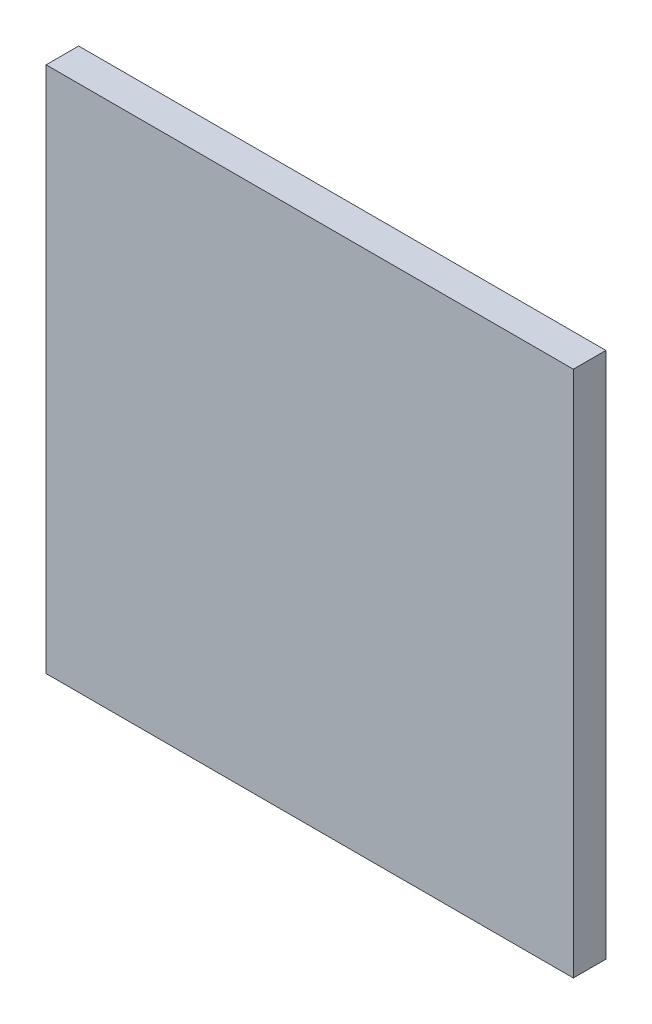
ISO-10303-21;
HEADER;
FILE_DESCRIPTION(('STEP AP214'),'2;1');
FILE_NAME('part.step','',(''),(''),'','','');
FILE_SCHEMA(('AUTOMOTIVE_DESIGN { 1 0 10303 214 1 1 1 1 }'));
ENDSEC;
DATA;
#1=APPLICATION_CONTEXT('core data for automotive mechanical design processes');
#2=APPLICATION_PROTOCOL_DEFINITION('international standard','automotive_design',2000,#1);
#3=PRODUCT_CONTEXT('',#1,'mechanical');
#4=PRODUCT('Part','Part','',(#3));
#5=PRODUCT_RELATED_PRODUCT_CATEGORY('part','',(#4));
#6=PRODUCT_DEFINITION_FORMATION('','',#4);
#7=PRODUCT_DEFINITION_CONTEXT('part definition',#1,'design');
#8=PRODUCT_DEFINITION('design','',#6,#7);
#9=PRODUCT_DEFINITION_SHAPE('','',#8);
#10=(LENGTH_UNIT() NAMED_UNIT(*) SI_UNIT(.MILLI.,.METRE.));
#11=(NAMED_UNIT(*) PLANE_ANGLE_UNIT() SI_UNIT($,.RADIAN.));
#12=(NAMED_UNIT(*) SI_UNIT($,.STERADIAN.) SOLID_ANGLE_UNIT());
#13=UNCERTAINTY_MEASURE_WITH_UNIT(LENGTH_MEASURE(1.E-05),#10,'distance_accuracy_value','');
#14=(GEOMETRIC_REPRESENTATION_CONTEXT(3) GLOBAL_UNCERTAINTY_ASSIGNED_CONTEXT((#13)) GLOBAL_UNIT_ASSIGNED_CONTEXT((#10,
#11,#12)) REPRESENTATION_CONTEXT('',''));
#15=CARTESIAN_POINT('',(0.,0.,0.));
#16=DIRECTION('',(0.,0.,1.));
#17=DIRECTION('',(1.,0.,0.));
#18=AXIS2_PLACEMENT_3D('',#15,#16,#17);
#19=CARTESIAN_POINT('',(0.,0.,1.00000000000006));
#20=DIRECTION('',(0.,0.,1.));
#21=DIRECTION('',(1.,0.,0.));
#22=AXIS2_PLACEMENT_3D('',#19,#20,#21);
#23=PLANE('',#22);
#24=DIRECTION('',(0.,1.,0.));
#25=VECTOR('',#24,1.);
#26=CARTESIAN_POINT('',(-8.10000000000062,8.10000000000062,1.00000000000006));
#27=LINE('',#26,#25);
#28=CARTESIAN_POINT('',(-8.10000000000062,-8.10000000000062,1.00000000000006));
#29=VERTEX_POINT('',#28);
#30=CARTESIAN_POINT('',(-8.10000000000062,8.10000000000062,1.00000000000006));
#31=VERTEX_POINT('',#30);
#32=EDGE_CURVE('E67',#29,#31,#27,.T.);
#33=ORIENTED_EDGE('',*,*,#32,.F.);
#34=DIRECTION('',(1.,0.,0.));
#35=VECTOR('',#34,1.);
#36=CARTESIAN_POINT('',(-8.10000000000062,-8.10000000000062,1.00000000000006));
#37=LINE('',#36,#35);
#38=CARTESIAN_POINT('',(8.10000000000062,-8.10000000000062,1.00000000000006));
#39=VERTEX_POINT('',#38);
#40=EDGE_CURVE('E19',#39,#29,#37,.F.);
#41=ORIENTED_EDGE('',*,*,#40,.F.);
#42=DIRECTION('',(0.,1.,0.));
#43=VECTOR('',#42,1.);
#44=CARTESIAN_POINT('',(8.10000000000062,-8.10000000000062,1.00000000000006));
#45=LINE('',#44,#43);
#46=CARTESIAN_POINT('',(8.10000000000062,8.10000000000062,1.00000000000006));
#47=VERTEX_POINT('',#46);
#48=EDGE_CURVE('E57',#47,#39,#45,.F.);
#49=ORIENTED_EDGE('',*,*,#48,.F.);
#50=DIRECTION('',(1.,0.,0.));
#51=VECTOR('',#50,1.);
#52=CARTESIAN_POINT('',(8.10000000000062,8.10000000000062,1.00000000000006));
#53=LINE('',#52,#51);
#54=EDGE_CURVE('E52',#31,#47,#53,.T.);
#55=ORIENTED_EDGE('',*,*,#54,.F.);
#56=EDGE_LOOP('',(#33,#41,#49,#55));
#57=FACE_BOUND('',#56,.T.);
#58=ADVANCED_FACE('F16',(#57),#23,.T.);
#59=CARTESIAN_POINT('',(-8.10000000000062,-8.10000000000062,0.));
#60=DIRECTION('',(0.,-1.,0.));
#61=DIRECTION('',(0.,0.,-1.));
#62=AXIS2_PLACEMENT_3D('',#59,#60,#61);
#63=PLANE('',#62);
#64=DIRECTION('',(0.,0.,1.));
#65=VECTOR('',#64,1.);
#66=CARTESIAN_POINT('',(-8.10000000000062,-8.10000000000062,0.));
#67=LINE('',#66,#65);
#68=CARTESIAN_POINT('',(-8.10000000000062,-8.10000000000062,0.));
#69=VERTEX_POINT('',#68);
#70=EDGE_CURVE('E78',#69,#29,#67,.T.);
#71=ORIENTED_EDGE('',*,*,#70,.F.);
#72=DIRECTION('',(1.,0.,0.));
#73=VECTOR('',#72,1.);
#74=CARTESIAN_POINT('',(0.,-8.10000000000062,0.));
#75=LINE('',#74,#73);
#76=CARTESIAN_POINT('',(8.10000000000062,-8.10000000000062,0.));
#77=VERTEX_POINT('',#76);
#78=EDGE_CURVE('E73',#69,#77,#75,.T.);
#79=ORIENTED_EDGE('',*,*,#78,.T.);
#80=DIRECTION('',(0.,0.,-1.));
#81=VECTOR('',#80,1.);
#82=CARTESIAN_POINT('',(8.10000000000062,-8.10000000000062,0.));
#83=LINE('',#82,#81);
#84=EDGE_CURVE('E62',#39,#77,#83,.T.);
#85=ORIENTED_EDGE('',*,*,#84,.F.);
#86=ORIENTED_EDGE('',*,*,#40,.T.);
#87=EDGE_LOOP('',(#71,#79,#85,#86));
#88=FACE_BOUND('',#87,.T.);
#89=ADVANCED_FACE('F72',(#88),#63,.T.);
#90=CARTESIAN_POINT('',(8.10000000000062,-8.10000000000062,0.));
#91=DIRECTION('',(1.,0.,0.));
#92=DIRECTION('',(0.,0.,-1.));
#93=AXIS2_PLACEMENT_3D('',#90,#91,#92);
#94=PLANE('',#93);
#95=ORIENTED_EDGE('',*,*,#84,.T.);
#96=DIRECTION('',(0.,1.,0.));
#97=VECTOR('',#96,1.);
#98=CARTESIAN_POINT('',(8.10000000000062,0.,0.));
#99=LINE('',#98,#97);
#100=CARTESIAN_POINT('',(8.10000000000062,8.10000000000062,0.));
#101=VERTEX_POINT('',#100);
#102=EDGE_CURVE('E83',#77,#101,#99,.T.);
#103=ORIENTED_EDGE('',*,*,#102,.T.);
#104=DIRECTION('',(0.,0.,1.));
#105=VECTOR('',#104,1.);
#106=CARTESIAN_POINT('',(8.10000000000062,8.10000000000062,0.));
#107=LINE('',#106,#105);
#108=EDGE_CURVE('E64',#47,#101,#107,.F.);
#109=ORIENTED_EDGE('',*,*,#108,.F.);
#110=ORIENTED_EDGE('',*,*,#48,.T.);
#111=EDGE_LOOP('',(#95,#103,#109,#110));
#112=FACE_BOUND('',#111,.T.);
#113=ADVANCED_FACE('F59',(#112),#94,.T.);
#114=CARTESIAN_POINT('',(8.10000000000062,8.10000000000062,0.));
#115=DIRECTION('',(0.,1.,0.));
#116=DIRECTION('',(0.,0.,1.));
#117=AXIS2_PLACEMENT_3D('',#114,#115,#116);
#118=PLANE('',#117);
#119=ORIENTED_EDGE('',*,*,#108,.T.);
#120=DIRECTION('',(1.,0.,0.));
#121=VECTOR('',#120,1.);
#122=CARTESIAN_POINT('',(0.,8.10000000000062,0.));
#123=LINE('',#122,#121);
#124=CARTESIAN_POINT('',(-8.10000000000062,8.10000000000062,0.));
#125=VERTEX_POINT('',#124);
#126=EDGE_CURVE('E25',#101,#125,#123,.F.);
#127=ORIENTED_EDGE('',*,*,#126,.T.);
#128=DIRECTION('',(0.,0.,1.));
#129=VECTOR('',#128,1.);
#130=CARTESIAN_POINT('',(-8.10000000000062,8.10000000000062,0.));
#131=LINE('',#130,#129);
#132=EDGE_CURVE('E33',#31,#125,#131,.F.);
#133=ORIENTED_EDGE('',*,*,#132,.F.);
#134=ORIENTED_EDGE('',*,*,#54,.T.);
#135=EDGE_LOOP('',(#119,#127,#133,#134));
#136=FACE_BOUND('',#135,.T.);
#137=ADVANCED_FACE('F87',(#136),#118,.T.);
#138=CARTESIAN_POINT('',(-8.10000000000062,8.10000000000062,0.));
#139=DIRECTION('',(-1.,0.,0.));
#140=DIRECTION('',(0.,0.,1.));
#141=AXIS2_PLACEMENT_3D('',#138,#139,#140);
#142=PLANE('',#141);
#143=ORIENTED_EDGE('',*,*,#132,.T.);
#144=DIRECTION('',(0.,1.,0.));
#145=VECTOR('',#144,1.);
#146=CARTESIAN_POINT('',(-8.10000000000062,0.,0.));
#147=LINE('',#146,#145);
#148=EDGE_CURVE('E11',#125,#69,#147,.F.);
#149=ORIENTED_EDGE('',*,*,#148,.T.);
#150=ORIENTED_EDGE('',*,*,#70,.T.);
#151=ORIENTED_EDGE('',*,*,#32,.T.);
#152=EDGE_LOOP('',(#143,#149,#150,#151));
#153=FACE_BOUND('',#152,.T.);
#154=ADVANCED_FACE('F90',(#153),#142,.T.);
#155=CARTESIAN_POINT('',(0.,0.,0.));
#156=DIRECTION('',(0.,0.,1.));
#157=DIRECTION('',(1.,0.,0.));
#158=AXIS2_PLACEMENT_3D('',#155,#156,#157);
#159=PLANE('',#158);
#160=ORIENTED_EDGE('',*,*,#126,.F.);
#161=ORIENTED_EDGE('',*,*,#102,.F.);
#162=ORIENTED_EDGE('',*,*,#78,.F.);
#163=ORIENTED_EDGE('',*,*,#148,.F.);
#164=EDGE_LOOP('',(#160,#161,#162,#163));
#165=FACE_BOUND('',#164,.T.);
#166=ADVANCED_FACE('F89',(#165),#159,.F.);
#167=CLOSED_SHELL('',(#58,#89,#113,#137,#154,#166));
#168=MANIFOLD_SOLID_BREP('B1',#167);
#169=ADVANCED_BREP_SHAPE_REPRESENTATION('',(#18,#168),#14);
#170=SHAPE_DEFINITION_REPRESENTATION(#9,#169);
ENDSEC;
END-ISO-10303-21;
